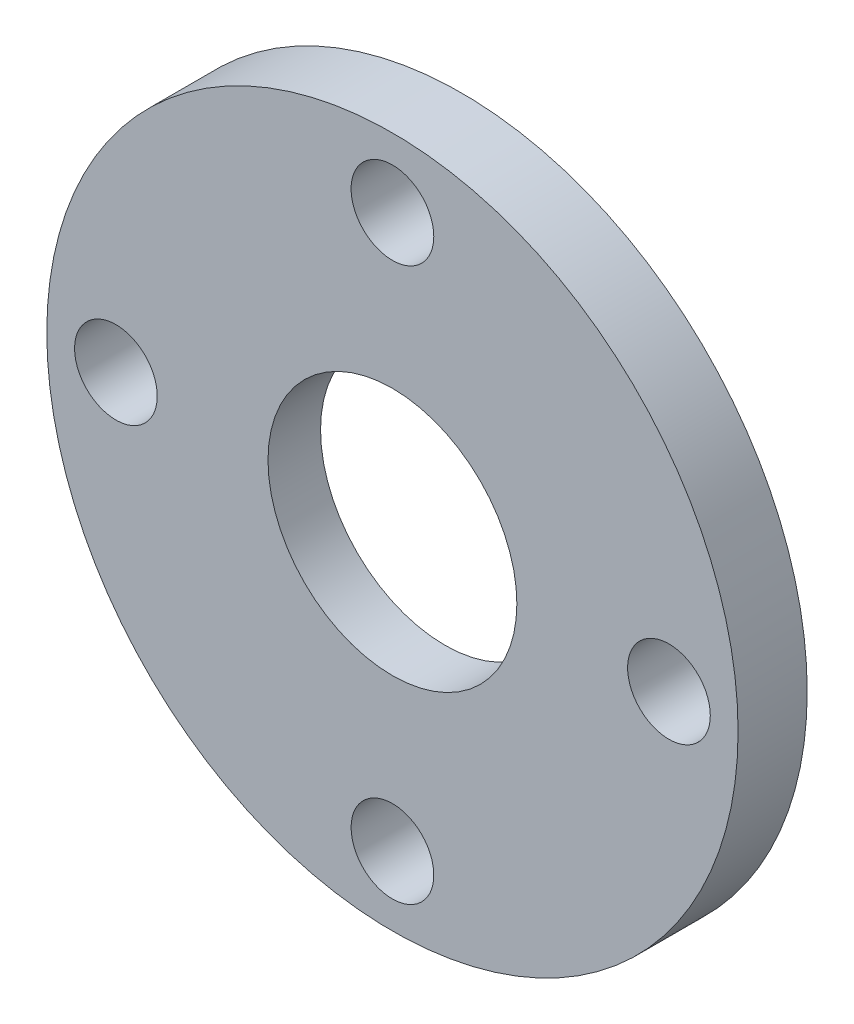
ISO-10303-21;
HEADER;
FILE_DESCRIPTION(('STEP AP214'),'2;1');
FILE_NAME('part.step','',(''),(''),'','','');
FILE_SCHEMA(('AUTOMOTIVE_DESIGN { 1 0 10303 214 1 1 1 1 }'));
ENDSEC;
DATA;
#1=APPLICATION_CONTEXT('core data for automotive mechanical design processes');
#2=APPLICATION_PROTOCOL_DEFINITION('international standard','automotive_design',2000,#1);
#3=PRODUCT_CONTEXT('',#1,'mechanical');
#4=PRODUCT('Part','Part','',(#3));
#5=PRODUCT_RELATED_PRODUCT_CATEGORY('part','',(#4));
#6=PRODUCT_DEFINITION_FORMATION('','',#4);
#7=PRODUCT_DEFINITION_CONTEXT('part definition',#1,'design');
#8=PRODUCT_DEFINITION('design','',#6,#7);
#9=PRODUCT_DEFINITION_SHAPE('','',#8);
#10=(LENGTH_UNIT() NAMED_UNIT(*) SI_UNIT(.MILLI.,.METRE.));
#11=(NAMED_UNIT(*) PLANE_ANGLE_UNIT() SI_UNIT($,.RADIAN.));
#12=(NAMED_UNIT(*) SI_UNIT($,.STERADIAN.) SOLID_ANGLE_UNIT());
#13=UNCERTAINTY_MEASURE_WITH_UNIT(LENGTH_MEASURE(1.E-05),#10,'distance_accuracy_value','');
#14=(GEOMETRIC_REPRESENTATION_CONTEXT(3) GLOBAL_UNCERTAINTY_ASSIGNED_CONTEXT((#13)) GLOBAL_UNIT_ASSIGNED_CONTEXT((#10,
#11,#12)) REPRESENTATION_CONTEXT('',''));
#15=CARTESIAN_POINT('',(0.,0.,0.));
#16=DIRECTION('',(0.,0.,1.));
#17=DIRECTION('',(1.,0.,0.));
#18=AXIS2_PLACEMENT_3D('',#15,#16,#17);
#19=CARTESIAN_POINT('',(0.,0.,0.));
#20=DIRECTION('',(0.,0.,1.));
#21=DIRECTION('',(1.,0.,0.));
#22=AXIS2_PLACEMENT_3D('',#19,#20,#21);
#23=PLANE('',#22);
#24=CARTESIAN_POINT('',(0.,12.7,0.));
#25=DIRECTION('',(0.,0.,1.));
#26=DIRECTION('',(1.,0.,0.));
#27=AXIS2_PLACEMENT_3D('',#24,#25,#26);
#28=CIRCLE('',#27,1.89865);
#29=CARTESIAN_POINT('',(1.89865,12.7,0.));
#30=VERTEX_POINT('',#29);
#31=EDGE_CURVE('E58',#30,#30,#28,.T.);
#32=ORIENTED_EDGE('',*,*,#31,.T.);
#33=EDGE_LOOP('',(#32));
#34=FACE_BOUND('',#33,.T.);
#35=CARTESIAN_POINT('',(0.,0.,0.));
#36=DIRECTION('',(0.,0.,1.));
#37=DIRECTION('',(1.,0.,0.));
#38=AXIS2_PLACEMENT_3D('',#35,#36,#37);
#39=CIRCLE('',#38,15.875);
#40=CARTESIAN_POINT('',(15.875,0.,0.));
#41=VERTEX_POINT('',#40);
#42=EDGE_CURVE('E42',#41,#41,#39,.T.);
#43=ORIENTED_EDGE('',*,*,#42,.F.);
#44=EDGE_LOOP('',(#43));
#45=FACE_BOUND('',#44,.T.);
#46=CARTESIAN_POINT('',(12.7,0.,0.));
#47=DIRECTION('',(0.,0.,1.));
#48=DIRECTION('',(1.,0.,0.));
#49=AXIS2_PLACEMENT_3D('',#46,#47,#48);
#50=CIRCLE('',#49,1.89865);
#51=CARTESIAN_POINT('',(14.59865,0.,0.));
#52=VERTEX_POINT('',#51);
#53=EDGE_CURVE('E52',#52,#52,#50,.T.);
#54=ORIENTED_EDGE('',*,*,#53,.T.);
#55=EDGE_LOOP('',(#54));
#56=FACE_BOUND('',#55,.T.);
#57=CARTESIAN_POINT('',(-12.7,0.,0.));
#58=DIRECTION('',(0.,0.,-1.));
#59=DIRECTION('',(-1.,0.,0.));
#60=AXIS2_PLACEMENT_3D('',#57,#58,#59);
#61=CIRCLE('',#60,1.89865);
#62=CARTESIAN_POINT('',(-14.59865,0.,0.));
#63=VERTEX_POINT('',#62);
#64=EDGE_CURVE('E64',#63,#63,#61,.T.);
#65=ORIENTED_EDGE('',*,*,#64,.F.);
#66=EDGE_LOOP('',(#65));
#67=FACE_BOUND('',#66,.T.);
#68=CARTESIAN_POINT('',(0.,-12.7,0.));
#69=DIRECTION('',(0.,0.,-1.));
#70=DIRECTION('',(-1.,0.,0.));
#71=AXIS2_PLACEMENT_3D('',#68,#69,#70);
#72=CIRCLE('',#71,1.89865);
#73=CARTESIAN_POINT('',(-1.89865,-12.7,0.));
#74=VERTEX_POINT('',#73);
#75=EDGE_CURVE('E70',#74,#74,#72,.T.);
#76=ORIENTED_EDGE('',*,*,#75,.F.);
#77=EDGE_LOOP('',(#76));
#78=FACE_BOUND('',#77,.T.);
#79=CARTESIAN_POINT('',(0.,0.,0.));
#80=DIRECTION('',(0.,0.,1.));
#81=DIRECTION('',(1.,0.,0.));
#82=AXIS2_PLACEMENT_3D('',#79,#80,#81);
#83=CIRCLE('',#82,7.9375);
#84=CARTESIAN_POINT('',(-7.9375,0.,0.));
#85=VERTEX_POINT('',#84);
#86=EDGE_CURVE('E75',#85,#85,#83,.T.);
#87=ORIENTED_EDGE('',*,*,#86,.T.);
#88=EDGE_LOOP('',(#87));
#89=FACE_BOUND('',#88,.T.);
#90=ADVANCED_FACE('F34',(#34,#45,#56,#67,#78,#89),#23,.F.);
#91=CARTESIAN_POINT('',(0.,0.,3.175));
#92=DIRECTION('',(0.,0.,1.));
#93=DIRECTION('',(1.,0.,0.));
#94=AXIS2_PLACEMENT_3D('',#91,#92,#93);
#95=PLANE('',#94);
#96=CARTESIAN_POINT('',(0.,-12.7,3.175));
#97=DIRECTION('',(0.,0.,-1.));
#98=DIRECTION('',(-1.,0.,0.));
#99=AXIS2_PLACEMENT_3D('',#96,#97,#98);
#100=CIRCLE('',#99,1.89865);
#101=CARTESIAN_POINT('',(-1.89865,-12.7,3.175));
#102=VERTEX_POINT('',#101);
#103=EDGE_CURVE('E67',#102,#102,#100,.T.);
#104=ORIENTED_EDGE('',*,*,#103,.T.);
#105=EDGE_LOOP('',(#104));
#106=FACE_BOUND('',#105,.T.);
#107=CARTESIAN_POINT('',(-12.7,0.,3.175));
#108=DIRECTION('',(0.,0.,-1.));
#109=DIRECTION('',(-1.,0.,0.));
#110=AXIS2_PLACEMENT_3D('',#107,#108,#109);
#111=CIRCLE('',#110,1.89865);
#112=CARTESIAN_POINT('',(-14.59865,0.,3.175));
#113=VERTEX_POINT('',#112);
#114=EDGE_CURVE('E61',#113,#113,#111,.T.);
#115=ORIENTED_EDGE('',*,*,#114,.T.);
#116=EDGE_LOOP('',(#115));
#117=FACE_BOUND('',#116,.T.);
#118=CARTESIAN_POINT('',(12.7,0.,3.175));
#119=DIRECTION('',(0.,0.,1.));
#120=DIRECTION('',(1.,0.,0.));
#121=AXIS2_PLACEMENT_3D('',#118,#119,#120);
#122=CIRCLE('',#121,1.89865);
#123=CARTESIAN_POINT('',(14.59865,0.,3.175));
#124=VERTEX_POINT('',#123);
#125=EDGE_CURVE('E51',#124,#124,#122,.T.);
#126=ORIENTED_EDGE('',*,*,#125,.F.);
#127=EDGE_LOOP('',(#126));
#128=FACE_BOUND('',#127,.T.);
#129=CARTESIAN_POINT('',(0.,0.,3.175));
#130=DIRECTION('',(0.,0.,1.));
#131=DIRECTION('',(1.,0.,0.));
#132=AXIS2_PLACEMENT_3D('',#129,#130,#131);
#133=CIRCLE('',#132,15.875);
#134=CARTESIAN_POINT('',(15.875,0.,3.175));
#135=VERTEX_POINT('',#134);
#136=EDGE_CURVE('E10',#135,#135,#133,.T.);
#137=ORIENTED_EDGE('',*,*,#136,.T.);
#138=EDGE_LOOP('',(#137));
#139=FACE_BOUND('',#138,.T.);
#140=CARTESIAN_POINT('',(0.,0.,3.175));
#141=DIRECTION('',(0.,0.,1.));
#142=DIRECTION('',(1.,0.,0.));
#143=AXIS2_PLACEMENT_3D('',#140,#141,#142);
#144=CIRCLE('',#143,5.715);
#145=CARTESIAN_POINT('',(5.715,0.,3.175));
#146=VERTEX_POINT('',#145);
#147=EDGE_CURVE('E47',#146,#146,#144,.T.);
#148=ORIENTED_EDGE('',*,*,#147,.F.);
#149=EDGE_LOOP('',(#148));
#150=FACE_BOUND('',#149,.T.);
#151=CARTESIAN_POINT('',(0.,12.7,3.175));
#152=DIRECTION('',(0.,0.,1.));
#153=DIRECTION('',(1.,0.,0.));
#154=AXIS2_PLACEMENT_3D('',#151,#152,#153);
#155=CIRCLE('',#154,1.89865);
#156=CARTESIAN_POINT('',(1.89865,12.7,3.175));
#157=VERTEX_POINT('',#156);
#158=EDGE_CURVE('E55',#157,#157,#155,.T.);
#159=ORIENTED_EDGE('',*,*,#158,.F.);
#160=EDGE_LOOP('',(#159));
#161=FACE_BOUND('',#160,.T.);
#162=ADVANCED_FACE('F95',(#106,#117,#128,#139,#150,#161),#95,.T.);
#163=CARTESIAN_POINT('',(0.,0.,3.175));
#164=DIRECTION('',(0.,0.,-1.));
#165=DIRECTION('',(-1.,0.,0.));
#166=AXIS2_PLACEMENT_3D('',#163,#164,#165);
#167=CYLINDRICAL_SURFACE('',#166,15.875);
#168=ORIENTED_EDGE('',*,*,#136,.F.);
#169=EDGE_LOOP('',(#168));
#170=FACE_BOUND('',#169,.T.);
#171=ORIENTED_EDGE('',*,*,#42,.T.);
#172=EDGE_LOOP('',(#171));
#173=FACE_BOUND('',#172,.T.);
#174=ADVANCED_FACE('F36',(#170,#173),#167,.T.);
#175=CARTESIAN_POINT('',(0.,0.,3.175));
#176=DIRECTION('',(0.,0.,-1.));
#177=DIRECTION('',(-1.,0.,0.));
#178=AXIS2_PLACEMENT_3D('',#175,#176,#177);
#179=CYLINDRICAL_SURFACE('',#178,5.715);
#180=CARTESIAN_POINT('',(0.,0.,0.762));
#181=DIRECTION('',(0.,0.,1.));
#182=DIRECTION('',(1.,0.,0.));
#183=AXIS2_PLACEMENT_3D('',#180,#181,#182);
#184=CIRCLE('',#183,5.715);
#185=CARTESIAN_POINT('',(5.715,0.,0.762));
#186=VERTEX_POINT('',#185);
#187=EDGE_CURVE('E38',#186,#186,#184,.T.);
#188=ORIENTED_EDGE('',*,*,#187,.F.);
#189=EDGE_LOOP('',(#188));
#190=FACE_BOUND('',#189,.T.);
#191=ORIENTED_EDGE('',*,*,#147,.T.);
#192=EDGE_LOOP('',(#191));
#193=FACE_BOUND('',#192,.T.);
#194=ADVANCED_FACE('F88',(#190,#193),#179,.F.);
#195=CARTESIAN_POINT('',(12.7,0.,3.175));
#196=DIRECTION('',(0.,0.,-1.));
#197=DIRECTION('',(-1.,0.,0.));
#198=AXIS2_PLACEMENT_3D('',#195,#196,#197);
#199=CYLINDRICAL_SURFACE('',#198,1.89865);
#200=ORIENTED_EDGE('',*,*,#125,.T.);
#201=EDGE_LOOP('',(#200));
#202=FACE_BOUND('',#201,.T.);
#203=ORIENTED_EDGE('',*,*,#53,.F.);
#204=EDGE_LOOP('',(#203));
#205=FACE_BOUND('',#204,.T.);
#206=ADVANCED_FACE('F91',(#202,#205),#199,.F.);
#207=CARTESIAN_POINT('',(0.,12.7,3.175));
#208=DIRECTION('',(0.,0.,-1.));
#209=DIRECTION('',(-1.,0.,0.));
#210=AXIS2_PLACEMENT_3D('',#207,#208,#209);
#211=CYLINDRICAL_SURFACE('',#210,1.89865);
#212=ORIENTED_EDGE('',*,*,#158,.T.);
#213=EDGE_LOOP('',(#212));
#214=FACE_BOUND('',#213,.T.);
#215=ORIENTED_EDGE('',*,*,#31,.F.);
#216=EDGE_LOOP('',(#215));
#217=FACE_BOUND('',#216,.T.);
#218=ADVANCED_FACE('F102',(#214,#217),#211,.F.);
#219=CARTESIAN_POINT('',(-12.7,0.,3.175));
#220=DIRECTION('',(0.,0.,-1.));
#221=DIRECTION('',(-1.,0.,0.));
#222=AXIS2_PLACEMENT_3D('',#219,#220,#221);
#223=CYLINDRICAL_SURFACE('',#222,1.89865);
#224=ORIENTED_EDGE('',*,*,#114,.F.);
#225=EDGE_LOOP('',(#224));
#226=FACE_BOUND('',#225,.T.);
#227=ORIENTED_EDGE('',*,*,#64,.T.);
#228=EDGE_LOOP('',(#227));
#229=FACE_BOUND('',#228,.T.);
#230=ADVANCED_FACE('F105',(#226,#229),#223,.F.);
#231=CARTESIAN_POINT('',(0.,-12.7,3.175));
#232=DIRECTION('',(0.,0.,-1.));
#233=DIRECTION('',(-1.,0.,0.));
#234=AXIS2_PLACEMENT_3D('',#231,#232,#233);
#235=CYLINDRICAL_SURFACE('',#234,1.89865);
#236=ORIENTED_EDGE('',*,*,#103,.F.);
#237=EDGE_LOOP('',(#236));
#238=FACE_BOUND('',#237,.T.);
#239=ORIENTED_EDGE('',*,*,#75,.T.);
#240=EDGE_LOOP('',(#239));
#241=FACE_BOUND('',#240,.T.);
#242=ADVANCED_FACE('F123',(#238,#241),#235,.F.);
#243=CARTESIAN_POINT('',(0.,0.,0.762));
#244=DIRECTION('',(0.,0.,-1.));
#245=DIRECTION('',(-1.,0.,0.));
#246=AXIS2_PLACEMENT_3D('',#243,#244,#245);
#247=CYLINDRICAL_SURFACE('',#246,7.9375);
#248=CARTESIAN_POINT('',(0.,0.,0.762));
#249=DIRECTION('',(0.,0.,1.));
#250=DIRECTION('',(1.,0.,0.));
#251=AXIS2_PLACEMENT_3D('',#248,#249,#250);
#252=CIRCLE('',#251,7.9375);
#253=CARTESIAN_POINT('',(-7.9375,0.,0.762));
#254=VERTEX_POINT('',#253);
#255=EDGE_CURVE('E78',#254,#254,#252,.T.);
#256=CARTESIAN_POINT('',(-7.9375,0.,0.762));
#257=CARTESIAN_POINT('',(-7.9375,0.,0.7540625));
#258=CARTESIAN_POINT('',(-7.9375,0.,0.746125));
#259=CARTESIAN_POINT('',(-7.9375,0.,0.73025));
#260=CARTESIAN_POINT('',(-7.9375,0.,0.7223125));
#261=CARTESIAN_POINT('',(-7.9375,0.,0.7064375));
#262=CARTESIAN_POINT('',(-7.9375,0.,0.6985));
#263=CARTESIAN_POINT('',(-7.9375,0.,0.682625));
#264=CARTESIAN_POINT('',(-7.9375,0.,0.6746875));
#265=CARTESIAN_POINT('',(-7.9375,0.,0.6588125));
#266=CARTESIAN_POINT('',(-7.9375,0.,0.650875));
#267=CARTESIAN_POINT('',(-7.9375,0.,0.635));
#268=CARTESIAN_POINT('',(-7.9375,0.,0.6270625));
#269=CARTESIAN_POINT('',(-7.9375,0.,0.6111875));
#270=CARTESIAN_POINT('',(-7.9375,0.,0.60325));
#271=CARTESIAN_POINT('',(-7.9375,0.,0.587375));
#272=CARTESIAN_POINT('',(-7.9375,0.,0.5794375));
#273=CARTESIAN_POINT('',(-7.9375,0.,0.5635625));
#274=CARTESIAN_POINT('',(-7.9375,0.,0.555625));
#275=CARTESIAN_POINT('',(-7.9375,0.,0.53975));
#276=CARTESIAN_POINT('',(-7.9375,0.,0.5318125));
#277=CARTESIAN_POINT('',(-7.9375,0.,0.5159375));
#278=CARTESIAN_POINT('',(-7.9375,0.,0.508));
#279=CARTESIAN_POINT('',(-7.9375,0.,0.492125));
#280=CARTESIAN_POINT('',(-7.9375,0.,0.4841875));
#281=CARTESIAN_POINT('',(-7.9375,0.,0.4683125));
#282=CARTESIAN_POINT('',(-7.9375,0.,0.460375));
#283=CARTESIAN_POINT('',(-7.9375,0.,0.4445));
#284=CARTESIAN_POINT('',(-7.9375,0.,0.4365625));
#285=CARTESIAN_POINT('',(-7.9375,0.,0.4206875));
#286=CARTESIAN_POINT('',(-7.9375,0.,0.41275));
#287=CARTESIAN_POINT('',(-7.9375,0.,0.396875));
#288=CARTESIAN_POINT('',(-7.9375,0.,0.3889375));
#289=CARTESIAN_POINT('',(-7.9375,0.,0.3730625));
#290=CARTESIAN_POINT('',(-7.9375,0.,0.365125));
#291=CARTESIAN_POINT('',(-7.9375,0.,0.34925));
#292=CARTESIAN_POINT('',(-7.9375,0.,0.3413125));
#293=CARTESIAN_POINT('',(-7.9375,0.,0.3254375));
#294=CARTESIAN_POINT('',(-7.9375,0.,0.3175));
#295=CARTESIAN_POINT('',(-7.9375,0.,0.301625));
#296=CARTESIAN_POINT('',(-7.9375,0.,0.2936875));
#297=CARTESIAN_POINT('',(-7.9375,0.,0.2778125));
#298=CARTESIAN_POINT('',(-7.9375,0.,0.269875));
#299=CARTESIAN_POINT('',(-7.9375,0.,0.254));
#300=CARTESIAN_POINT('',(-7.9375,0.,0.2460625));
#301=CARTESIAN_POINT('',(-7.9375,0.,0.2301875));
#302=CARTESIAN_POINT('',(-7.9375,0.,0.22225));
#303=CARTESIAN_POINT('',(-7.9375,0.,0.206375));
#304=CARTESIAN_POINT('',(-7.9375,0.,0.1984375));
#305=CARTESIAN_POINT('',(-7.9375,0.,0.1825625));
#306=CARTESIAN_POINT('',(-7.9375,0.,0.174625));
#307=CARTESIAN_POINT('',(-7.9375,0.,0.15875));
#308=CARTESIAN_POINT('',(-7.9375,0.,0.1508125));
#309=CARTESIAN_POINT('',(-7.9375,0.,0.1349375));
#310=CARTESIAN_POINT('',(-7.9375,0.,0.127));
#311=CARTESIAN_POINT('',(-7.9375,0.,0.111125));
#312=CARTESIAN_POINT('',(-7.9375,0.,0.1031875));
#313=CARTESIAN_POINT('',(-7.9375,0.,0.0873125));
#314=CARTESIAN_POINT('',(-7.9375,0.,0.079375));
#315=CARTESIAN_POINT('',(-7.9375,0.,0.0635));
#316=CARTESIAN_POINT('',(-7.9375,0.,0.0555625));
#317=CARTESIAN_POINT('',(-7.9375,0.,0.0396875));
#318=CARTESIAN_POINT('',(-7.9375,0.,0.03175));
#319=CARTESIAN_POINT('',(-7.9375,0.,0.015875));
#320=CARTESIAN_POINT('',(-7.9375,0.,0.00793749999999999));
#321=CARTESIAN_POINT('',(-7.9375,0.,0.));
#322=B_SPLINE_CURVE_WITH_KNOTS('',3,(#256,#257,#258,#259,#260,#261,#262,#263,#264,#265,#266,
#267,#268,#269,#270,#271,#272,#273,#274,#275,#276,#277,#278,#279,#280,#281,#282,#283,#284,#285,
#286,#287,#288,#289,#290,#291,#292,#293,#294,#295,#296,#297,#298,#299,#300,#301,#302,#303,#304,
#305,#306,#307,#308,#309,#310,#311,#312,#313,#314,#315,#316,#317,#318,#319,#320,#321),
.UNSPECIFIED.,.F.,.F.,(4,2,2,2,2,2,2,2,2,2,2,2,2,2,2,2,2,2,2,2,2,2,2,2,2,2,2,2,2,2,2,2,4),(0.,
0.0238125,0.0476249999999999,0.0714374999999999,0.09525,0.1190625,0.142875,0.1666875,0.1905,
0.2143125,0.238125,0.2619375,0.28575,0.3095625,0.333375,0.3571875,0.381,0.4048125,0.428625,
0.4524375,0.47625,0.5000625,0.523875,0.5476875,0.5715,0.5953125,0.619125,0.6429375,0.66675,
0.6905625,0.714375,0.7381875,0.762),.UNSPECIFIED.);
#323=EDGE_CURVE('BSEAM121',#254,#85,#322,.T.);
#324=ORIENTED_EDGE('',*,*,#255,.T.);
#325=ORIENTED_EDGE('',*,*,#86,.F.);
#326=ORIENTED_EDGE('',*,*,#323,.T.);
#327=ORIENTED_EDGE('',*,*,#323,.F.);
#328=EDGE_LOOP('',(#324,#326,#325,#327));
#329=FACE_BOUND('',#328,.T.);
#330=ADVANCED_FACE('F121',(#329),#247,.F.);
#331=CARTESIAN_POINT('',(0.,0.,0.762));
#332=DIRECTION('',(0.,0.,1.));
#333=DIRECTION('',(1.,0.,0.));
#334=AXIS2_PLACEMENT_3D('',#331,#332,#333);
#335=PLANE('',#334);
#336=ORIENTED_EDGE('',*,*,#187,.T.);
#337=EDGE_LOOP('',(#336));
#338=FACE_BOUND('',#337,.T.);
#339=ORIENTED_EDGE('',*,*,#255,.F.);
#340=EDGE_LOOP('',(#339));
#341=FACE_BOUND('',#340,.T.);
#342=ADVANCED_FACE('F85',(#338,#341),#335,.F.);
#343=CLOSED_SHELL('',(#90,#162,#174,#194,#206,#218,#230,#242,#330,#342));
#344=MANIFOLD_SOLID_BREP('B2',#343);
#345=ADVANCED_BREP_SHAPE_REPRESENTATION('',(#18,#344),#14);
#346=SHAPE_DEFINITION_REPRESENTATION(#9,#345);
ENDSEC;
END-ISO-10303-21;
